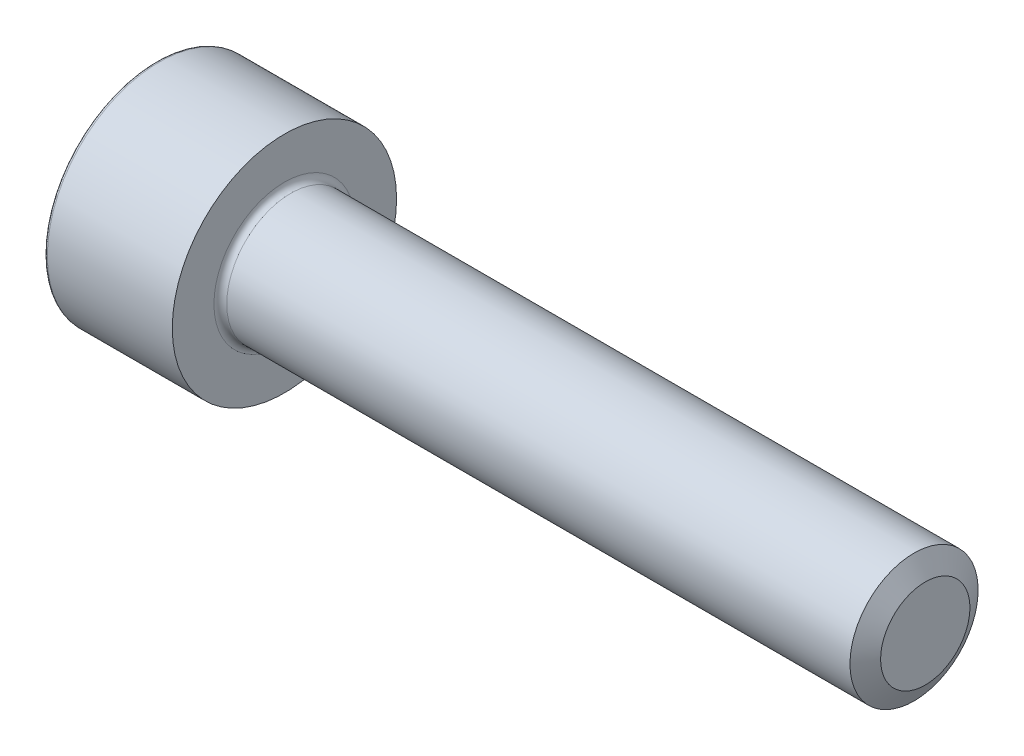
ISO-10303-21;
HEADER;
FILE_DESCRIPTION(('STEP AP214'),'2;1');
FILE_NAME('part.step','',(''),(''),'','','');
FILE_SCHEMA(('AUTOMOTIVE_DESIGN { 1 0 10303 214 1 1 1 1 }'));
ENDSEC;
DATA;
#1=APPLICATION_CONTEXT('core data for automotive mechanical design processes');
#2=APPLICATION_PROTOCOL_DEFINITION('international standard','automotive_design',2000,#1);
#3=PRODUCT_CONTEXT('',#1,'mechanical');
#4=PRODUCT('Part','Part','',(#3));
#5=PRODUCT_RELATED_PRODUCT_CATEGORY('part','',(#4));
#6=PRODUCT_DEFINITION_FORMATION('','',#4);
#7=PRODUCT_DEFINITION_CONTEXT('part definition',#1,'design');
#8=PRODUCT_DEFINITION('design','',#6,#7);
#9=PRODUCT_DEFINITION_SHAPE('','',#8);
#10=(LENGTH_UNIT() NAMED_UNIT(*) SI_UNIT(.MILLI.,.METRE.));
#11=(NAMED_UNIT(*) PLANE_ANGLE_UNIT() SI_UNIT($,.RADIAN.));
#12=(NAMED_UNIT(*) SI_UNIT($,.STERADIAN.) SOLID_ANGLE_UNIT());
#13=UNCERTAINTY_MEASURE_WITH_UNIT(LENGTH_MEASURE(1.E-05),#10,'distance_accuracy_value','');
#14=(GEOMETRIC_REPRESENTATION_CONTEXT(3) GLOBAL_UNCERTAINTY_ASSIGNED_CONTEXT((#13)) GLOBAL_UNIT_ASSIGNED_CONTEXT((#10,
#11,#12)) REPRESENTATION_CONTEXT('',''));
#15=CARTESIAN_POINT('',(0.,0.,0.));
#16=DIRECTION('',(0.,0.,1.));
#17=DIRECTION('',(1.,0.,0.));
#18=AXIS2_PLACEMENT_3D('',#15,#16,#17);
#19=CARTESIAN_POINT('',(2.,0.,-1.72));
#20=DIRECTION('',(0.,-0.5,-0.866025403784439));
#21=DIRECTION('',(0.,0.866025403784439,-0.5));
#22=AXIS2_PLACEMENT_3D('',#19,#20,#21);
#23=PLANE('',#22);
#24=DIRECTION('',(1.,0.,0.));
#25=VECTOR('',#24,1.);
#26=CARTESIAN_POINT('',(2.,-1.48956369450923,-0.86));
#27=LINE('',#26,#25);
#28=CARTESIAN_POINT('',(0.,-1.48956369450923,-0.86));
#29=VERTEX_POINT('',#28);
#30=CARTESIAN_POINT('',(2.,-1.48956369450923,-0.86));
#31=VERTEX_POINT('',#30);
#32=EDGE_CURVE('E99',#29,#31,#27,.T.);
#33=ORIENTED_EDGE('',*,*,#32,.T.);
#34=DIRECTION('',(0.,0.866025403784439,-0.5));
#35=VECTOR('',#34,1.);
#36=CARTESIAN_POINT('',(2.,0.,-1.72));
#37=LINE('',#36,#35);
#38=CARTESIAN_POINT('',(2.,0.,-1.72));
#39=VERTEX_POINT('',#38);
#40=EDGE_CURVE('E87',#39,#31,#37,.F.);
#41=ORIENTED_EDGE('',*,*,#40,.F.);
#42=DIRECTION('',(1.,0.,0.));
#43=VECTOR('',#42,1.);
#44=CARTESIAN_POINT('',(2.,0.,-1.72));
#45=LINE('',#44,#43);
#46=CARTESIAN_POINT('',(0.,0.,-1.72));
#47=VERTEX_POINT('',#46);
#48=EDGE_CURVE('E113',#39,#47,#45,.F.);
#49=ORIENTED_EDGE('',*,*,#48,.T.);
#50=DIRECTION('',(0.,0.866025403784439,-0.5));
#51=VECTOR('',#50,1.);
#52=CARTESIAN_POINT('',(0.,0.,-1.72));
#53=LINE('',#52,#51);
#54=EDGE_CURVE('E82',#29,#47,#53,.T.);
#55=ORIENTED_EDGE('',*,*,#54,.F.);
#56=EDGE_LOOP('',(#33,#41,#49,#55));
#57=FACE_BOUND('',#56,.T.);
#58=ADVANCED_FACE('F17',(#57),#23,.F.);
#59=CARTESIAN_POINT('',(2.,-1.48956369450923,-0.86));
#60=DIRECTION('',(0.,-1.,0.));
#61=DIRECTION('',(0.,0.,-1.));
#62=AXIS2_PLACEMENT_3D('',#59,#60,#61);
#63=PLANE('',#62);
#64=DIRECTION('',(1.,0.,0.));
#65=VECTOR('',#64,1.);
#66=CARTESIAN_POINT('',(2.,-1.48956369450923,0.86));
#67=LINE('',#66,#65);
#68=CARTESIAN_POINT('',(0.,-1.48956369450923,0.86));
#69=VERTEX_POINT('',#68);
#70=CARTESIAN_POINT('',(2.,-1.48956369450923,0.86));
#71=VERTEX_POINT('',#70);
#72=EDGE_CURVE('E105',#69,#71,#67,.T.);
#73=ORIENTED_EDGE('',*,*,#72,.T.);
#74=DIRECTION('',(0.,0.,-1.));
#75=VECTOR('',#74,1.);
#76=CARTESIAN_POINT('',(2.,-1.48956369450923,-0.86));
#77=LINE('',#76,#75);
#78=EDGE_CURVE('E91',#31,#71,#77,.F.);
#79=ORIENTED_EDGE('',*,*,#78,.F.);
#80=ORIENTED_EDGE('',*,*,#32,.F.);
#81=DIRECTION('',(0.,0.,-1.));
#82=VECTOR('',#81,1.);
#83=CARTESIAN_POINT('',(0.,-1.48956369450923,-0.86));
#84=LINE('',#83,#82);
#85=EDGE_CURVE('E108',#69,#29,#84,.T.);
#86=ORIENTED_EDGE('',*,*,#85,.F.);
#87=EDGE_LOOP('',(#73,#79,#80,#86));
#88=FACE_BOUND('',#87,.T.);
#89=ADVANCED_FACE('F103',(#88),#63,.F.);
#90=CARTESIAN_POINT('',(2.,1.48956369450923,-0.86));
#91=DIRECTION('',(0.,0.5,-0.866025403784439));
#92=DIRECTION('',(0.,0.866025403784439,0.5));
#93=AXIS2_PLACEMENT_3D('',#90,#91,#92);
#94=PLANE('',#93);
#95=ORIENTED_EDGE('',*,*,#48,.F.);
#96=DIRECTION('',(0.,-0.866025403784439,-0.5));
#97=VECTOR('',#96,1.);
#98=CARTESIAN_POINT('',(2.,1.48956369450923,-0.86));
#99=LINE('',#98,#97);
#100=CARTESIAN_POINT('',(2.,1.48956369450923,-0.86));
#101=VERTEX_POINT('',#100);
#102=EDGE_CURVE('E94',#101,#39,#99,.T.);
#103=ORIENTED_EDGE('',*,*,#102,.F.);
#104=DIRECTION('',(1.,0.,0.));
#105=VECTOR('',#104,1.);
#106=CARTESIAN_POINT('',(2.,1.48956369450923,-0.86));
#107=LINE('',#106,#105);
#108=CARTESIAN_POINT('',(0.,1.48956369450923,-0.86));
#109=VERTEX_POINT('',#108);
#110=EDGE_CURVE('E231',#101,#109,#107,.F.);
#111=ORIENTED_EDGE('',*,*,#110,.T.);
#112=DIRECTION('',(0.,0.866025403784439,0.5));
#113=VECTOR('',#112,1.);
#114=CARTESIAN_POINT('',(0.,1.48956369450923,-0.86));
#115=LINE('',#114,#113);
#116=EDGE_CURVE('E249',#47,#109,#115,.T.);
#117=ORIENTED_EDGE('',*,*,#116,.F.);
#118=EDGE_LOOP('',(#95,#103,#111,#117));
#119=FACE_BOUND('',#118,.T.);
#120=ADVANCED_FACE('F254',(#119),#94,.F.);
#121=CARTESIAN_POINT('',(2.,-1.48956369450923,0.86));
#122=DIRECTION('',(0.,-0.5,0.866025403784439));
#123=DIRECTION('',(0.,-0.866025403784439,-0.5));
#124=AXIS2_PLACEMENT_3D('',#121,#122,#123);
#125=PLANE('',#124);
#126=DIRECTION('',(1.,0.,0.));
#127=VECTOR('',#126,1.);
#128=CARTESIAN_POINT('',(2.,0.,1.72));
#129=LINE('',#128,#127);
#130=CARTESIAN_POINT('',(0.,0.,1.72));
#131=VERTEX_POINT('',#130);
#132=CARTESIAN_POINT('',(2.,0.,1.72));
#133=VERTEX_POINT('',#132);
#134=EDGE_CURVE('E225',#131,#133,#129,.T.);
#135=ORIENTED_EDGE('',*,*,#134,.T.);
#136=DIRECTION('',(0.,0.866025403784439,0.5));
#137=VECTOR('',#136,1.);
#138=CARTESIAN_POINT('',(2.,-1.48956369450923,0.86));
#139=LINE('',#138,#137);
#140=EDGE_CURVE('E240',#71,#133,#139,.T.);
#141=ORIENTED_EDGE('',*,*,#140,.F.);
#142=ORIENTED_EDGE('',*,*,#72,.F.);
#143=DIRECTION('',(0.,-0.866025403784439,-0.5));
#144=VECTOR('',#143,1.);
#145=CARTESIAN_POINT('',(0.,-1.48956369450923,0.86));
#146=LINE('',#145,#144);
#147=EDGE_CURVE('E243',#131,#69,#146,.T.);
#148=ORIENTED_EDGE('',*,*,#147,.F.);
#149=EDGE_LOOP('',(#135,#141,#142,#148));
#150=FACE_BOUND('',#149,.T.);
#151=ADVANCED_FACE('F263',(#150),#125,.F.);
#152=CARTESIAN_POINT('',(2.,1.48956369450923,2.58));
#153=DIRECTION('',(-1.,0.,0.));
#154=DIRECTION('',(0.,0.,1.));
#155=AXIS2_PLACEMENT_3D('',#152,#153,#154);
#156=PLANE('',#155);
#157=ORIENTED_EDGE('',*,*,#40,.T.);
#158=ORIENTED_EDGE('',*,*,#78,.T.);
#159=ORIENTED_EDGE('',*,*,#140,.T.);
#160=DIRECTION('',(0.,-0.866025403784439,0.5));
#161=VECTOR('',#160,1.);
#162=CARTESIAN_POINT('',(2.,0.,1.72));
#163=LINE('',#162,#161);
#164=CARTESIAN_POINT('',(2.,1.48956369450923,0.859999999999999));
#165=VERTEX_POINT('',#164);
#166=EDGE_CURVE('E222',#133,#165,#163,.F.);
#167=ORIENTED_EDGE('',*,*,#166,.T.);
#168=DIRECTION('',(0.,0.,1.));
#169=VECTOR('',#168,1.);
#170=CARTESIAN_POINT('',(2.,1.48956369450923,0.859999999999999));
#171=LINE('',#170,#169);
#172=EDGE_CURVE('E235',#165,#101,#171,.F.);
#173=ORIENTED_EDGE('',*,*,#172,.T.);
#174=ORIENTED_EDGE('',*,*,#102,.T.);
#175=EDGE_LOOP('',(#157,#158,#159,#167,#173,#174));
#176=FACE_BOUND('',#175,.T.);
#177=ADVANCED_FACE('F88',(#176),#156,.T.);
#178=CARTESIAN_POINT('',(2.,1.48956369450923,0.859999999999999));
#179=DIRECTION('',(0.,1.,0.));
#180=DIRECTION('',(0.,0.,1.));
#181=AXIS2_PLACEMENT_3D('',#178,#179,#180);
#182=PLANE('',#181);
#183=ORIENTED_EDGE('',*,*,#110,.F.);
#184=ORIENTED_EDGE('',*,*,#172,.F.);
#185=DIRECTION('',(1.,0.,0.));
#186=VECTOR('',#185,1.);
#187=CARTESIAN_POINT('',(2.,1.48956369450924,0.859999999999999));
#188=LINE('',#187,#186);
#189=CARTESIAN_POINT('',(0.,1.48956369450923,0.859999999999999));
#190=VERTEX_POINT('',#189);
#191=EDGE_CURVE('E212',#165,#190,#188,.F.);
#192=ORIENTED_EDGE('',*,*,#191,.T.);
#193=DIRECTION('',(0.,0.,1.));
#194=VECTOR('',#193,1.);
#195=CARTESIAN_POINT('',(0.,1.48956369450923,0.859999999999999));
#196=LINE('',#195,#194);
#197=EDGE_CURVE('E228',#109,#190,#196,.T.);
#198=ORIENTED_EDGE('',*,*,#197,.F.);
#199=EDGE_LOOP('',(#183,#184,#192,#198));
#200=FACE_BOUND('',#199,.T.);
#201=ADVANCED_FACE('F270',(#200),#182,.F.);
#202=CARTESIAN_POINT('',(2.,0.,1.72));
#203=DIRECTION('',(0.,0.5,0.866025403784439));
#204=DIRECTION('',(0.,-0.866025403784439,0.5));
#205=AXIS2_PLACEMENT_3D('',#202,#203,#204);
#206=PLANE('',#205);
#207=ORIENTED_EDGE('',*,*,#191,.F.);
#208=ORIENTED_EDGE('',*,*,#166,.F.);
#209=ORIENTED_EDGE('',*,*,#134,.F.);
#210=DIRECTION('',(0.,0.866025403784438,-0.5));
#211=VECTOR('',#210,1.);
#212=CARTESIAN_POINT('',(0.,0.,1.72));
#213=LINE('',#212,#211);
#214=EDGE_CURVE('E221',#131,#190,#213,.T.);
#215=ORIENTED_EDGE('',*,*,#214,.T.);
#216=EDGE_LOOP('',(#207,#208,#209,#215));
#217=FACE_BOUND('',#216,.T.);
#218=ADVANCED_FACE('F268',(#217),#206,.F.);
#219=CARTESIAN_POINT('',(0.,0.,0.));
#220=DIRECTION('',(1.,0.,0.));
#221=DIRECTION('',(0.,0.,-1.));
#222=AXIS2_PLACEMENT_3D('',#219,#220,#221);
#223=PLANE('',#222);
#224=ORIENTED_EDGE('',*,*,#147,.T.);
#225=ORIENTED_EDGE('',*,*,#85,.T.);
#226=ORIENTED_EDGE('',*,*,#54,.T.);
#227=ORIENTED_EDGE('',*,*,#116,.T.);
#228=ORIENTED_EDGE('',*,*,#197,.T.);
#229=ORIENTED_EDGE('',*,*,#214,.F.);
#230=EDGE_LOOP('',(#224,#225,#226,#227,#228,#229));
#231=FACE_BOUND('',#230,.T.);
#232=CARTESIAN_POINT('',(0.,0.,0.));
#233=DIRECTION('',(1.,0.,0.));
#234=DIRECTION('',(0.,0.,-1.));
#235=AXIS2_PLACEMENT_3D('',#232,#233,#234);
#236=CIRCLE('',#235,3.4);
#237=CARTESIAN_POINT('',(0.,0.,-3.4));
#238=VERTEX_POINT('',#237);
#239=CARTESIAN_POINT('',(0.,0.,3.4));
#240=VERTEX_POINT('',#239);
#241=EDGE_CURVE('E191',#238,#240,#236,.T.);
#242=ORIENTED_EDGE('',*,*,#241,.F.);
#243=CARTESIAN_POINT('',(0.,0.,0.));
#244=DIRECTION('',(1.,0.,0.));
#245=DIRECTION('',(0.,0.,1.));
#246=AXIS2_PLACEMENT_3D('',#243,#244,#245);
#247=CIRCLE('',#246,3.4);
#248=EDGE_CURVE('E293',#240,#238,#247,.T.);
#249=ORIENTED_EDGE('',*,*,#248,.F.);
#250=EDGE_LOOP('',(#242,#249));
#251=FACE_BOUND('',#250,.T.);
#252=ADVANCED_FACE('F200',(#231,#251),#223,.F.);
#253=CARTESIAN_POINT('',(0.1,0.,0.));
#254=DIRECTION('',(1.,0.,0.));
#255=DIRECTION('',(0.,0.,-1.));
#256=AXIS2_PLACEMENT_3D('',#253,#254,#255);
#257=TOROIDAL_SURFACE('',#256,3.4,0.1);
#258=CARTESIAN_POINT('',(0.1,0.,0.));
#259=DIRECTION('',(-1.,0.,0.));
#260=DIRECTION('',(0.,0.,1.));
#261=AXIS2_PLACEMENT_3D('',#258,#259,#260);
#262=CIRCLE('',#261,3.5);
#263=CARTESIAN_POINT('',(0.1,0.,3.5));
#264=VERTEX_POINT('',#263);
#265=EDGE_CURVE('E128',#264,#264,#262,.F.);
#266=ORIENTED_EDGE('',*,*,#265,.F.);
#267=EDGE_LOOP('',(#266));
#268=FACE_BOUND('',#267,.T.);
#269=ORIENTED_EDGE('',*,*,#241,.T.);
#270=ORIENTED_EDGE('',*,*,#248,.T.);
#271=EDGE_LOOP('',(#269,#270));
#272=FACE_BOUND('',#271,.T.);
#273=ADVANCED_FACE('F195',(#268,#272),#257,.T.);
#274=CARTESIAN_POINT('',(0.,0.,0.));
#275=DIRECTION('',(-1.,0.,0.));
#276=DIRECTION('',(0.,0.,1.));
#277=AXIS2_PLACEMENT_3D('',#274,#275,#276);
#278=CYLINDRICAL_SURFACE('',#277,3.5);
#279=ORIENTED_EDGE('',*,*,#265,.T.);
#280=EDGE_LOOP('',(#279));
#281=FACE_BOUND('',#280,.T.);
#282=CARTESIAN_POINT('',(4.,0.,0.));
#283=DIRECTION('',(-1.,0.,0.));
#284=DIRECTION('',(0.,0.,1.));
#285=AXIS2_PLACEMENT_3D('',#282,#283,#284);
#286=CIRCLE('',#285,3.5);
#287=CARTESIAN_POINT('',(4.,0.,3.5));
#288=VERTEX_POINT('',#287);
#289=EDGE_CURVE('E124',#288,#288,#286,.T.);
#290=ORIENTED_EDGE('',*,*,#289,.T.);
#291=EDGE_LOOP('',(#290));
#292=FACE_BOUND('',#291,.T.);
#293=ADVANCED_FACE('F199',(#281,#292),#278,.T.);
#294=CARTESIAN_POINT('',(24.,2.,0.));
#295=DIRECTION('',(-1.,0.,0.));
#296=DIRECTION('',(0.,0.,1.));
#297=AXIS2_PLACEMENT_3D('',#294,#295,#296);
#298=PLANE('',#297);
#299=CARTESIAN_POINT('',(24.0000000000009,0.,0.));
#300=DIRECTION('',(-1.,0.,0.));
#301=DIRECTION('',(0.,0.,1.));
#302=AXIS2_PLACEMENT_3D('',#299,#300,#301);
#303=CIRCLE('',#302,1.3938000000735);
#304=CARTESIAN_POINT('',(24.0000000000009,0.,1.3938000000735));
#305=VERTEX_POINT('',#304);
#306=EDGE_CURVE('E119',#305,#305,#303,.T.);
#307=ORIENTED_EDGE('',*,*,#306,.F.);
#308=EDGE_LOOP('',(#307));
#309=FACE_BOUND('',#308,.T.);
#310=ADVANCED_FACE('F167',(#309),#298,.F.);
#311=CARTESIAN_POINT('',(4.,3.5,0.));
#312=DIRECTION('',(-1.,0.,0.));
#313=DIRECTION('',(0.,0.,1.));
#314=AXIS2_PLACEMENT_3D('',#311,#312,#313);
#315=PLANE('',#314);
#316=CARTESIAN_POINT('',(4.,0.,0.));
#317=DIRECTION('',(1.,0.,0.));
#318=DIRECTION('',(0.,0.,1.));
#319=AXIS2_PLACEMENT_3D('',#316,#317,#318);
#320=CIRCLE('',#319,2.2);
#321=CARTESIAN_POINT('',(4.,0.,-2.2));
#322=VERTEX_POINT('',#321);
#323=CARTESIAN_POINT('',(4.,0.,2.2));
#324=VERTEX_POINT('',#323);
#325=EDGE_CURVE('E123',#322,#324,#320,.F.);
#326=ORIENTED_EDGE('',*,*,#325,.T.);
#327=CARTESIAN_POINT('',(4.,0.,0.));
#328=DIRECTION('',(1.,0.,0.));
#329=DIRECTION('',(0.,0.,-1.));
#330=AXIS2_PLACEMENT_3D('',#327,#328,#329);
#331=CIRCLE('',#330,2.2);
#332=EDGE_CURVE('E37',#324,#322,#331,.F.);
#333=ORIENTED_EDGE('',*,*,#332,.T.);
#334=EDGE_LOOP('',(#326,#333));
#335=FACE_BOUND('',#334,.T.);
#336=ORIENTED_EDGE('',*,*,#289,.F.);
#337=EDGE_LOOP('',(#336));
#338=FACE_BOUND('',#337,.T.);
#339=ADVANCED_FACE('F158',(#335,#338),#315,.F.);
#340=CARTESIAN_POINT('',(23.6500102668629,0.,0.));
#341=DIRECTION('',(-1.,0.,0.));
#342=DIRECTION('',(0.,0.,1.));
#343=AXIS2_PLACEMENT_3D('',#340,#341,#342);
#344=CONICAL_SURFACE('',#343,2.00000000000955,1.04719755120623);
#345=CARTESIAN_POINT('',(23.6500102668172,0.,0.));
#346=DIRECTION('',(-1.,0.,0.));
#347=DIRECTION('',(0.,0.,1.));
#348=AXIS2_PLACEMENT_3D('',#345,#346,#347);
#349=CIRCLE('',#348,2.);
#350=CARTESIAN_POINT('',(23.6500102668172,0.,2.));
#351=VERTEX_POINT('',#350);
#352=EDGE_CURVE('E29',#351,#351,#349,.T.);
#353=ORIENTED_EDGE('',*,*,#352,.F.);
#354=EDGE_LOOP('',(#353));
#355=FACE_BOUND('',#354,.T.);
#356=ORIENTED_EDGE('',*,*,#306,.T.);
#357=EDGE_LOOP('',(#356));
#358=FACE_BOUND('',#357,.T.);
#359=ADVANCED_FACE('F147',(#355,#358),#344,.T.);
#360=CARTESIAN_POINT('',(4.2,0.,0.));
#361=DIRECTION('',(-1.,0.,0.));
#362=DIRECTION('',(0.,0.,1.));
#363=AXIS2_PLACEMENT_3D('',#360,#361,#362);
#364=TOROIDAL_SURFACE('',#363,2.2,0.2);
#365=ORIENTED_EDGE('',*,*,#332,.F.);
#366=ORIENTED_EDGE('',*,*,#325,.F.);
#367=EDGE_LOOP('',(#365,#366));
#368=FACE_BOUND('',#367,.T.);
#369=CARTESIAN_POINT('',(4.2,0.,0.));
#370=DIRECTION('',(-1.,0.,0.));
#371=DIRECTION('',(0.,0.,1.));
#372=AXIS2_PLACEMENT_3D('',#369,#370,#371);
#373=CIRCLE('',#372,2.);
#374=CARTESIAN_POINT('',(4.2,0.,2.));
#375=VERTEX_POINT('',#374);
#376=EDGE_CURVE('E11',#375,#375,#373,.F.);
#377=ORIENTED_EDGE('',*,*,#376,.F.);
#378=EDGE_LOOP('',(#377));
#379=FACE_BOUND('',#378,.T.);
#380=ADVANCED_FACE('F135',(#368,#379),#364,.F.);
#381=CARTESIAN_POINT('',(0.,0.,0.));
#382=DIRECTION('',(-1.,0.,0.));
#383=DIRECTION('',(0.,0.,1.));
#384=AXIS2_PLACEMENT_3D('',#381,#382,#383);
#385=CYLINDRICAL_SURFACE('',#384,2.);
#386=ORIENTED_EDGE('',*,*,#376,.T.);
#387=EDGE_LOOP('',(#386));
#388=FACE_BOUND('',#387,.T.);
#389=ORIENTED_EDGE('',*,*,#352,.T.);
#390=EDGE_LOOP('',(#389));
#391=FACE_BOUND('',#390,.T.);
#392=ADVANCED_FACE('F146',(#388,#391),#385,.T.);
#393=CLOSED_SHELL('',(#58,#89,#120,#151,#177,#201,#218,#252,#273,#293,#310,#339,#359,#380,#392));
#394=MANIFOLD_SOLID_BREP('B1',#393);
#395=ADVANCED_BREP_SHAPE_REPRESENTATION('',(#18,#394),#14);
#396=SHAPE_DEFINITION_REPRESENTATION(#9,#395);
ENDSEC;
END-ISO-10303-21;
